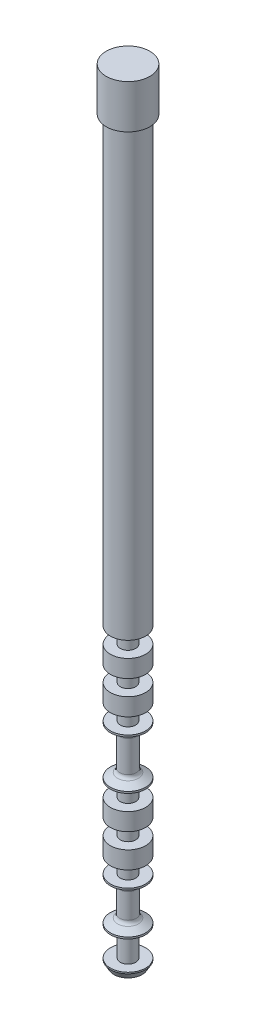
ISO-10303-21;
HEADER;
FILE_DESCRIPTION(('STEP AP214'),'2;1');
FILE_NAME('part.step','',(''),(''),'','','');
FILE_SCHEMA(('AUTOMOTIVE_DESIGN { 1 0 10303 214 1 1 1 1 }'));
ENDSEC;
DATA;
#1=APPLICATION_CONTEXT('core data for automotive mechanical design processes');
#2=APPLICATION_PROTOCOL_DEFINITION('international standard','automotive_design',2000,#1);
#3=PRODUCT_CONTEXT('',#1,'mechanical');
#4=PRODUCT('Part','Part','',(#3));
#5=PRODUCT_RELATED_PRODUCT_CATEGORY('part','',(#4));
#6=PRODUCT_DEFINITION_FORMATION('','',#4);
#7=PRODUCT_DEFINITION_CONTEXT('part definition',#1,'design');
#8=PRODUCT_DEFINITION('design','',#6,#7);
#9=PRODUCT_DEFINITION_SHAPE('','',#8);
#10=(LENGTH_UNIT() NAMED_UNIT(*) SI_UNIT(.MILLI.,.METRE.));
#11=(NAMED_UNIT(*) PLANE_ANGLE_UNIT() SI_UNIT($,.RADIAN.));
#12=(NAMED_UNIT(*) SI_UNIT($,.STERADIAN.) SOLID_ANGLE_UNIT());
#13=UNCERTAINTY_MEASURE_WITH_UNIT(LENGTH_MEASURE(1.E-05),#10,'distance_accuracy_value','');
#14=(GEOMETRIC_REPRESENTATION_CONTEXT(3) GLOBAL_UNCERTAINTY_ASSIGNED_CONTEXT((#13)) GLOBAL_UNIT_ASSIGNED_CONTEXT((#10,
#11,#12)) REPRESENTATION_CONTEXT('',''));
#15=CARTESIAN_POINT('',(0.,0.,0.));
#16=DIRECTION('',(0.,0.,1.));
#17=DIRECTION('',(1.,0.,0.));
#18=AXIS2_PLACEMENT_3D('',#15,#16,#17);
#19=CARTESIAN_POINT('',(58.02,-58.2,1.65));
#20=DIRECTION('',(0.,-1.,0.));
#21=DIRECTION('',(0.,0.,-1.));
#22=AXIS2_PLACEMENT_3D('',#19,#20,#21);
#23=PLANE('',#22);
#24=CARTESIAN_POINT('',(56.,-58.2,1.65));
#25=DIRECTION('',(0.,-1.,0.));
#26=DIRECTION('',(0.,0.,-1.));
#27=AXIS2_PLACEMENT_3D('',#24,#25,#26);
#28=CIRCLE('',#27,2.02000000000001);
#29=CARTESIAN_POINT('',(56.,-58.2,-0.370000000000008));
#30=VERTEX_POINT('',#29);
#31=EDGE_CURVE('E100',#30,#30,#28,.T.);
#32=ORIENTED_EDGE('',*,*,#31,.T.);
#33=EDGE_LOOP('',(#32));
#34=FACE_BOUND('',#33,.T.);
#35=CARTESIAN_POINT('',(56.,-58.2,1.65));
#36=DIRECTION('',(0.,-1.,0.));
#37=DIRECTION('',(0.,0.,-1.));
#38=AXIS2_PLACEMENT_3D('',#35,#36,#37);
#39=CIRCLE('',#38,0.880000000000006);
#40=CARTESIAN_POINT('',(56.,-58.2,0.769999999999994));
#41=VERTEX_POINT('',#40);
#42=EDGE_CURVE('E236',#41,#41,#39,.T.);
#43=ORIENTED_EDGE('',*,*,#42,.F.);
#44=EDGE_LOOP('',(#43));
#45=FACE_BOUND('',#44,.T.);
#46=ADVANCED_FACE('F50',(#34,#45),#23,.T.);
#47=CARTESIAN_POINT('',(56.,-1065.45754338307,1.65));
#48=DIRECTION('',(0.,-1.,0.));
#49=DIRECTION('',(0.,0.,-1.));
#50=AXIS2_PLACEMENT_3D('',#47,#48,#49);
#51=CYLINDRICAL_SURFACE('',#50,2.02);
#52=CARTESIAN_POINT('',(56.,-7.40000000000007,1.65));
#53=DIRECTION('',(0.,-1.,0.));
#54=DIRECTION('',(0.,0.,-1.));
#55=AXIS2_PLACEMENT_3D('',#52,#53,#54);
#56=CIRCLE('',#55,2.02);
#57=CARTESIAN_POINT('',(56.,-7.40000000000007,-0.370000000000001));
#58=VERTEX_POINT('',#57);
#59=EDGE_CURVE('E104',#58,#58,#56,.T.);
#60=ORIENTED_EDGE('',*,*,#59,.T.);
#61=EDGE_LOOP('',(#60));
#62=FACE_BOUND('',#61,.T.);
#63=ORIENTED_EDGE('',*,*,#31,.F.);
#64=EDGE_LOOP('',(#63));
#65=FACE_BOUND('',#64,.T.);
#66=ADVANCED_FACE('F246',(#62,#65),#51,.T.);
#67=CARTESIAN_POINT('',(58.02,-7.4,1.65));
#68=DIRECTION('',(0.,-1.,0.));
#69=DIRECTION('',(0.,0.,-1.));
#70=AXIS2_PLACEMENT_3D('',#67,#68,#69);
#71=PLANE('',#70);
#72=CARTESIAN_POINT('',(56.,-7.40000000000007,1.65));
#73=DIRECTION('',(0.,-1.,0.));
#74=DIRECTION('',(0.,0.,-1.));
#75=AXIS2_PLACEMENT_3D('',#72,#73,#74);
#76=CIRCLE('',#75,2.5);
#77=CARTESIAN_POINT('',(56.,-7.40000000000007,-0.850000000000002));
#78=VERTEX_POINT('',#77);
#79=EDGE_CURVE('E108',#78,#78,#76,.T.);
#80=ORIENTED_EDGE('',*,*,#79,.T.);
#81=EDGE_LOOP('',(#80));
#82=FACE_BOUND('',#81,.T.);
#83=ORIENTED_EDGE('',*,*,#59,.F.);
#84=EDGE_LOOP('',(#83));
#85=FACE_BOUND('',#84,.T.);
#86=ADVANCED_FACE('F252',(#82,#85),#71,.T.);
#87=CARTESIAN_POINT('',(56.,-1065.45754338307,1.65));
#88=DIRECTION('',(0.,-1.,0.));
#89=DIRECTION('',(0.,0.,-1.));
#90=AXIS2_PLACEMENT_3D('',#87,#88,#89);
#91=CYLINDRICAL_SURFACE('',#90,2.5);
#92=CARTESIAN_POINT('',(56.,-2.39999999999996,1.65));
#93=DIRECTION('',(0.,-1.,0.));
#94=DIRECTION('',(0.,0.,-1.));
#95=AXIS2_PLACEMENT_3D('',#92,#93,#94);
#96=CIRCLE('',#95,2.5);
#97=CARTESIAN_POINT('',(56.,-2.39999999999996,-0.850000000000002));
#98=VERTEX_POINT('',#97);
#99=EDGE_CURVE('E112',#98,#98,#96,.T.);
#100=ORIENTED_EDGE('',*,*,#99,.T.);
#101=EDGE_LOOP('',(#100));
#102=FACE_BOUND('',#101,.T.);
#103=ORIENTED_EDGE('',*,*,#79,.F.);
#104=EDGE_LOOP('',(#103));
#105=FACE_BOUND('',#104,.T.);
#106=ADVANCED_FACE('F385',(#102,#105),#91,.T.);
#107=CARTESIAN_POINT('',(58.5,-2.4,1.65));
#108=DIRECTION('',(0.,1.,0.));
#109=DIRECTION('',(0.,0.,1.));
#110=AXIS2_PLACEMENT_3D('',#107,#108,#109);
#111=PLANE('',#110);
#112=ORIENTED_EDGE('',*,*,#99,.F.);
#113=EDGE_LOOP('',(#112));
#114=FACE_BOUND('',#113,.T.);
#115=ADVANCED_FACE('F382',(#114),#111,.T.);
#116=CARTESIAN_POINT('',(58.02,-92.,1.65));
#117=DIRECTION('',(0.,-1.,0.));
#118=DIRECTION('',(0.,0.,-1.));
#119=AXIS2_PLACEMENT_3D('',#116,#117,#118);
#120=PLANE('',#119);
#121=CARTESIAN_POINT('',(56.,-92.,1.65));
#122=DIRECTION('',(0.,-1.,0.));
#123=DIRECTION('',(0.,0.,-1.));
#124=AXIS2_PLACEMENT_3D('',#121,#122,#123);
#125=CIRCLE('',#124,1.62);
#126=CARTESIAN_POINT('',(56.,-92.,0.0299999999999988));
#127=VERTEX_POINT('',#126);
#128=EDGE_CURVE('E58',#127,#127,#125,.T.);
#129=ORIENTED_EDGE('',*,*,#128,.T.);
#130=EDGE_LOOP('',(#129));
#131=FACE_BOUND('',#130,.T.);
#132=ADVANCED_FACE('F379',(#131),#120,.T.);
#133=CARTESIAN_POINT('',(56.,-1065.45754338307,1.65));
#134=DIRECTION('',(0.,-1.,0.));
#135=DIRECTION('',(0.,0.,-1.));
#136=AXIS2_PLACEMENT_3D('',#133,#134,#135);
#137=CYLINDRICAL_SURFACE('',#136,2.02000000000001);
#138=CARTESIAN_POINT('',(56.,-91.3071796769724,1.65));
#139=DIRECTION('',(0.,-1.,0.));
#140=DIRECTION('',(0.,0.,-1.));
#141=AXIS2_PLACEMENT_3D('',#138,#139,#140);
#142=CIRCLE('',#141,2.02000000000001);
#143=CARTESIAN_POINT('',(56.,-91.3071796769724,-0.370000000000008));
#144=VERTEX_POINT('',#143);
#145=EDGE_CURVE('E13',#144,#144,#142,.F.);
#146=ORIENTED_EDGE('',*,*,#145,.T.);
#147=EDGE_LOOP('',(#146));
#148=FACE_BOUND('',#147,.T.);
#149=CARTESIAN_POINT('',(56.,-91.1500000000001,1.65));
#150=DIRECTION('',(0.,-1.,0.));
#151=DIRECTION('',(0.,0.,-1.));
#152=AXIS2_PLACEMENT_3D('',#149,#150,#151);
#153=CIRCLE('',#152,2.02000000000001);
#154=CARTESIAN_POINT('',(56.,-91.1500000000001,-0.370000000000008));
#155=VERTEX_POINT('',#154);
#156=EDGE_CURVE('E116',#155,#155,#153,.T.);
#157=ORIENTED_EDGE('',*,*,#156,.T.);
#158=EDGE_LOOP('',(#157));
#159=FACE_BOUND('',#158,.T.);
#160=ADVANCED_FACE('F375',(#148,#159),#137,.T.);
#161=CARTESIAN_POINT('',(56.88,-91.15,1.65));
#162=DIRECTION('',(0.,1.,0.));
#163=DIRECTION('',(0.,0.,1.));
#164=AXIS2_PLACEMENT_3D('',#161,#162,#163);
#165=PLANE('',#164);
#166=CARTESIAN_POINT('',(56.,-91.1500000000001,1.65));
#167=DIRECTION('',(0.,-1.,0.));
#168=DIRECTION('',(0.,0.,-1.));
#169=AXIS2_PLACEMENT_3D('',#166,#167,#168);
#170=CIRCLE('',#169,0.879999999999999);
#171=CARTESIAN_POINT('',(56.,-91.1500000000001,0.770000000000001));
#172=VERTEX_POINT('',#171);
#173=EDGE_CURVE('E120',#172,#172,#170,.T.);
#174=ORIENTED_EDGE('',*,*,#173,.T.);
#175=EDGE_LOOP('',(#174));
#176=FACE_BOUND('',#175,.T.);
#177=ORIENTED_EDGE('',*,*,#156,.F.);
#178=EDGE_LOOP('',(#177));
#179=FACE_BOUND('',#178,.T.);
#180=ADVANCED_FACE('F371',(#176,#179),#165,.T.);
#181=CARTESIAN_POINT('',(56.,-1065.45754338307,1.65));
#182=DIRECTION('',(0.,-1.,0.));
#183=DIRECTION('',(0.,0.,-1.));
#184=AXIS2_PLACEMENT_3D('',#181,#182,#183);
#185=CYLINDRICAL_SURFACE('',#184,0.879999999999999);
#186=CARTESIAN_POINT('',(56.,-87.85,1.65));
#187=DIRECTION('',(0.,-1.,0.));
#188=DIRECTION('',(0.,0.,-1.));
#189=AXIS2_PLACEMENT_3D('',#186,#187,#188);
#190=CIRCLE('',#189,0.879999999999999);
#191=CARTESIAN_POINT('',(56.,-87.85,0.770000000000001));
#192=VERTEX_POINT('',#191);
#193=EDGE_CURVE('E124',#192,#192,#190,.T.);
#194=ORIENTED_EDGE('',*,*,#193,.T.);
#195=EDGE_LOOP('',(#194));
#196=FACE_BOUND('',#195,.T.);
#197=ORIENTED_EDGE('',*,*,#173,.F.);
#198=EDGE_LOOP('',(#197));
#199=FACE_BOUND('',#198,.T.);
#200=ADVANCED_FACE('F367',(#196,#199),#185,.T.);
#201=CARTESIAN_POINT('',(58.02,-87.85,1.65));
#202=DIRECTION('',(0.,-1.,0.));
#203=DIRECTION('',(0.,0.,-1.));
#204=AXIS2_PLACEMENT_3D('',#201,#202,#203);
#205=PLANE('',#204);
#206=CARTESIAN_POINT('',(56.,-87.85,1.65));
#207=DIRECTION('',(0.,-1.,0.));
#208=DIRECTION('',(0.,0.,-1.));
#209=AXIS2_PLACEMENT_3D('',#206,#207,#208);
#210=CIRCLE('',#209,2.02000000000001);
#211=CARTESIAN_POINT('',(56.,-87.85,-0.370000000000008));
#212=VERTEX_POINT('',#211);
#213=EDGE_CURVE('E128',#212,#212,#210,.T.);
#214=ORIENTED_EDGE('',*,*,#213,.T.);
#215=EDGE_LOOP('',(#214));
#216=FACE_BOUND('',#215,.T.);
#217=ORIENTED_EDGE('',*,*,#193,.F.);
#218=EDGE_LOOP('',(#217));
#219=FACE_BOUND('',#218,.T.);
#220=ADVANCED_FACE('F363',(#216,#219),#205,.T.);
#221=CARTESIAN_POINT('',(56.,-1065.45754338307,1.65));
#222=DIRECTION('',(0.,-1.,0.));
#223=DIRECTION('',(0.,0.,-1.));
#224=AXIS2_PLACEMENT_3D('',#221,#222,#223);
#225=CYLINDRICAL_SURFACE('',#224,2.02000000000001);
#226=CARTESIAN_POINT('',(56.,-87.65,1.65));
#227=DIRECTION('',(0.,-1.,0.));
#228=DIRECTION('',(0.,0.,-1.));
#229=AXIS2_PLACEMENT_3D('',#226,#227,#228);
#230=CIRCLE('',#229,2.02000000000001);
#231=CARTESIAN_POINT('',(56.,-87.65,-0.370000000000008));
#232=VERTEX_POINT('',#231);
#233=EDGE_CURVE('E132',#232,#232,#230,.T.);
#234=ORIENTED_EDGE('',*,*,#233,.T.);
#235=EDGE_LOOP('',(#234));
#236=FACE_BOUND('',#235,.T.);
#237=ORIENTED_EDGE('',*,*,#213,.F.);
#238=EDGE_LOOP('',(#237));
#239=FACE_BOUND('',#238,.T.);
#240=ADVANCED_FACE('F359',(#236,#239),#225,.T.);
#241=CARTESIAN_POINT('',(56.,-87.65,1.65));
#242=DIRECTION('',(0.,-1.,0.));
#243=DIRECTION('',(0.,0.,-1.));
#244=AXIS2_PLACEMENT_3D('',#241,#242,#243);
#245=CONICAL_SURFACE('',#244,2.02000000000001,1.04719755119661);
#246=CARTESIAN_POINT('',(56.,-87.1765727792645,1.65));
#247=DIRECTION('',(0.,-1.,0.));
#248=DIRECTION('',(0.,0.,-1.));
#249=AXIS2_PLACEMENT_3D('',#246,#247,#248);
#250=CIRCLE('',#249,1.19999999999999);
#251=CARTESIAN_POINT('',(56.,-87.1765727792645,0.450000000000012));
#252=VERTEX_POINT('',#251);
#253=EDGE_CURVE('E96',#252,#252,#250,.T.);
#254=ORIENTED_EDGE('',*,*,#253,.T.);
#255=EDGE_LOOP('',(#254));
#256=FACE_BOUND('',#255,.T.);
#257=ORIENTED_EDGE('',*,*,#233,.F.);
#258=EDGE_LOOP('',(#257));
#259=FACE_BOUND('',#258,.T.);
#260=ADVANCED_FACE('F355',(#256,#259),#245,.T.);
#261=CARTESIAN_POINT('',(56.,-1065.45754338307,1.65));
#262=DIRECTION('',(0.,-1.,0.));
#263=DIRECTION('',(0.,0.,-1.));
#264=AXIS2_PLACEMENT_3D('',#261,#262,#263);
#265=CYLINDRICAL_SURFACE('',#264,0.95);
#266=CARTESIAN_POINT('',(56.,-86.7435600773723,1.65));
#267=DIRECTION('',(0.,-1.,0.));
#268=DIRECTION('',(0.,0.,-1.));
#269=AXIS2_PLACEMENT_3D('',#266,#267,#268);
#270=CIRCLE('',#269,0.95);
#271=CARTESIAN_POINT('',(56.,-86.7435600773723,0.700000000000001));
#272=VERTEX_POINT('',#271);
#273=EDGE_CURVE('E88',#272,#272,#270,.F.);
#274=ORIENTED_EDGE('',*,*,#273,.T.);
#275=EDGE_LOOP('',(#274));
#276=FACE_BOUND('',#275,.T.);
#277=CARTESIAN_POINT('',(56.,-83.9064399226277,1.65));
#278=DIRECTION('',(0.,-1.,0.));
#279=DIRECTION('',(0.,0.,-1.));
#280=AXIS2_PLACEMENT_3D('',#277,#278,#279);
#281=CIRCLE('',#280,0.95);
#282=CARTESIAN_POINT('',(56.,-83.9064399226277,0.700000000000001));
#283=VERTEX_POINT('',#282);
#284=EDGE_CURVE('E92',#283,#283,#281,.T.);
#285=ORIENTED_EDGE('',*,*,#284,.T.);
#286=EDGE_LOOP('',(#285));
#287=FACE_BOUND('',#286,.T.);
#288=ADVANCED_FACE('F351',(#276,#287),#265,.T.);
#289=CARTESIAN_POINT('',(56.,-83.617764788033,1.65));
#290=DIRECTION('',(0.,1.,0.));
#291=DIRECTION('',(0.,0.,1.));
#292=AXIS2_PLACEMENT_3D('',#289,#290,#291);
#293=CONICAL_SURFACE('',#292,0.95,1.04719755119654);
#294=CARTESIAN_POINT('',(56.,-83.4734272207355,1.65));
#295=DIRECTION('',(0.,1.,0.));
#296=DIRECTION('',(0.,0.,1.));
#297=AXIS2_PLACEMENT_3D('',#294,#295,#296);
#298=CIRCLE('',#297,1.19999999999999);
#299=CARTESIAN_POINT('',(56.,-83.4734272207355,2.84999999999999));
#300=VERTEX_POINT('',#299);
#301=EDGE_CURVE('E84',#300,#300,#298,.T.);
#302=ORIENTED_EDGE('',*,*,#301,.T.);
#303=EDGE_LOOP('',(#302));
#304=FACE_BOUND('',#303,.T.);
#305=CARTESIAN_POINT('',(56.,-83.,1.65));
#306=DIRECTION('',(0.,-1.,0.));
#307=DIRECTION('',(0.,0.,-1.));
#308=AXIS2_PLACEMENT_3D('',#305,#306,#307);
#309=CIRCLE('',#308,2.02000000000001);
#310=CARTESIAN_POINT('',(56.,-83.,-0.370000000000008));
#311=VERTEX_POINT('',#310);
#312=EDGE_CURVE('E136',#311,#311,#309,.T.);
#313=ORIENTED_EDGE('',*,*,#312,.T.);
#314=EDGE_LOOP('',(#313));
#315=FACE_BOUND('',#314,.T.);
#316=ADVANCED_FACE('F347',(#304,#315),#293,.T.);
#317=CARTESIAN_POINT('',(56.,-1065.45754338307,1.65));
#318=DIRECTION('',(0.,-1.,0.));
#319=DIRECTION('',(0.,0.,-1.));
#320=AXIS2_PLACEMENT_3D('',#317,#318,#319);
#321=CYLINDRICAL_SURFACE('',#320,2.02000000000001);
#322=CARTESIAN_POINT('',(56.,-82.8,1.65));
#323=DIRECTION('',(0.,-1.,0.));
#324=DIRECTION('',(0.,0.,-1.));
#325=AXIS2_PLACEMENT_3D('',#322,#323,#324);
#326=CIRCLE('',#325,2.02000000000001);
#327=CARTESIAN_POINT('',(56.,-82.8,-0.370000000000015));
#328=VERTEX_POINT('',#327);
#329=EDGE_CURVE('E140',#328,#328,#326,.T.);
#330=ORIENTED_EDGE('',*,*,#329,.T.);
#331=EDGE_LOOP('',(#330));
#332=FACE_BOUND('',#331,.T.);
#333=ORIENTED_EDGE('',*,*,#312,.F.);
#334=EDGE_LOOP('',(#333));
#335=FACE_BOUND('',#334,.T.);
#336=ADVANCED_FACE('F343',(#332,#335),#321,.T.);
#337=CARTESIAN_POINT('',(56.88,-82.8,1.65));
#338=DIRECTION('',(0.,1.,0.));
#339=DIRECTION('',(0.,0.,1.));
#340=AXIS2_PLACEMENT_3D('',#337,#338,#339);
#341=PLANE('',#340);
#342=CARTESIAN_POINT('',(56.,-82.8,1.65));
#343=DIRECTION('',(0.,-1.,0.));
#344=DIRECTION('',(0.,0.,-1.));
#345=AXIS2_PLACEMENT_3D('',#342,#343,#344);
#346=CIRCLE('',#345,0.879999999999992);
#347=CARTESIAN_POINT('',(56.,-82.8,0.770000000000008));
#348=VERTEX_POINT('',#347);
#349=EDGE_CURVE('E144',#348,#348,#346,.T.);
#350=ORIENTED_EDGE('',*,*,#349,.T.);
#351=EDGE_LOOP('',(#350));
#352=FACE_BOUND('',#351,.T.);
#353=ORIENTED_EDGE('',*,*,#329,.F.);
#354=EDGE_LOOP('',(#353));
#355=FACE_BOUND('',#354,.T.);
#356=ADVANCED_FACE('F339',(#352,#355),#341,.T.);
#357=CARTESIAN_POINT('',(56.,-1065.45754338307,1.65));
#358=DIRECTION('',(0.,-1.,0.));
#359=DIRECTION('',(0.,0.,-1.));
#360=AXIS2_PLACEMENT_3D('',#357,#358,#359);
#361=CYLINDRICAL_SURFACE('',#360,0.879999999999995);
#362=CARTESIAN_POINT('',(56.,-81.,1.65));
#363=DIRECTION('',(0.,-1.,0.));
#364=DIRECTION('',(0.,0.,-1.));
#365=AXIS2_PLACEMENT_3D('',#362,#363,#364);
#366=CIRCLE('',#365,0.879999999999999);
#367=CARTESIAN_POINT('',(56.,-81.,0.770000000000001));
#368=VERTEX_POINT('',#367);
#369=EDGE_CURVE('E148',#368,#368,#366,.T.);
#370=ORIENTED_EDGE('',*,*,#369,.T.);
#371=EDGE_LOOP('',(#370));
#372=FACE_BOUND('',#371,.T.);
#373=ORIENTED_EDGE('',*,*,#349,.F.);
#374=EDGE_LOOP('',(#373));
#375=FACE_BOUND('',#374,.T.);
#376=ADVANCED_FACE('F335',(#372,#375),#361,.T.);
#377=CARTESIAN_POINT('',(58.02,-81.,1.65));
#378=DIRECTION('',(0.,-1.,0.));
#379=DIRECTION('',(0.,0.,-1.));
#380=AXIS2_PLACEMENT_3D('',#377,#378,#379);
#381=PLANE('',#380);
#382=CARTESIAN_POINT('',(56.,-81.,1.65));
#383=DIRECTION('',(0.,-1.,0.));
#384=DIRECTION('',(0.,0.,-1.));
#385=AXIS2_PLACEMENT_3D('',#382,#383,#384);
#386=CIRCLE('',#385,2.02);
#387=CARTESIAN_POINT('',(56.,-81.,-0.370000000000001));
#388=VERTEX_POINT('',#387);
#389=EDGE_CURVE('E152',#388,#388,#386,.T.);
#390=ORIENTED_EDGE('',*,*,#389,.T.);
#391=EDGE_LOOP('',(#390));
#392=FACE_BOUND('',#391,.T.);
#393=ORIENTED_EDGE('',*,*,#369,.F.);
#394=EDGE_LOOP('',(#393));
#395=FACE_BOUND('',#394,.T.);
#396=ADVANCED_FACE('F331',(#392,#395),#381,.T.);
#397=CARTESIAN_POINT('',(56.,-1065.45754338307,1.65));
#398=DIRECTION('',(0.,-1.,0.));
#399=DIRECTION('',(0.,0.,-1.));
#400=AXIS2_PLACEMENT_3D('',#397,#398,#399);
#401=CYLINDRICAL_SURFACE('',#400,2.02);
#402=CARTESIAN_POINT('',(56.,-79.,1.65));
#403=DIRECTION('',(0.,-1.,0.));
#404=DIRECTION('',(0.,0.,-1.));
#405=AXIS2_PLACEMENT_3D('',#402,#403,#404);
#406=CIRCLE('',#405,2.02);
#407=CARTESIAN_POINT('',(56.,-79.,-0.370000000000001));
#408=VERTEX_POINT('',#407);
#409=EDGE_CURVE('E156',#408,#408,#406,.T.);
#410=ORIENTED_EDGE('',*,*,#409,.T.);
#411=EDGE_LOOP('',(#410));
#412=FACE_BOUND('',#411,.T.);
#413=ORIENTED_EDGE('',*,*,#389,.F.);
#414=EDGE_LOOP('',(#413));
#415=FACE_BOUND('',#414,.T.);
#416=ADVANCED_FACE('F327',(#412,#415),#401,.T.);
#417=CARTESIAN_POINT('',(56.88,-79.,1.65));
#418=DIRECTION('',(0.,1.,0.));
#419=DIRECTION('',(0.,0.,1.));
#420=AXIS2_PLACEMENT_3D('',#417,#418,#419);
#421=PLANE('',#420);
#422=CARTESIAN_POINT('',(56.,-79.,1.65));
#423=DIRECTION('',(0.,-1.,0.));
#424=DIRECTION('',(0.,0.,-1.));
#425=AXIS2_PLACEMENT_3D('',#422,#423,#424);
#426=CIRCLE('',#425,0.879999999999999);
#427=CARTESIAN_POINT('',(56.,-79.,0.770000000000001));
#428=VERTEX_POINT('',#427);
#429=EDGE_CURVE('E160',#428,#428,#426,.T.);
#430=ORIENTED_EDGE('',*,*,#429,.T.);
#431=EDGE_LOOP('',(#430));
#432=FACE_BOUND('',#431,.T.);
#433=ORIENTED_EDGE('',*,*,#409,.F.);
#434=EDGE_LOOP('',(#433));
#435=FACE_BOUND('',#434,.T.);
#436=ADVANCED_FACE('F323',(#432,#435),#421,.T.);
#437=CARTESIAN_POINT('',(56.,-1065.45754338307,1.65));
#438=DIRECTION('',(0.,-1.,0.));
#439=DIRECTION('',(0.,0.,-1.));
#440=AXIS2_PLACEMENT_3D('',#437,#438,#439);
#441=CYLINDRICAL_SURFACE('',#440,0.879999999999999);
#442=CARTESIAN_POINT('',(56.,-77.2,1.65));
#443=DIRECTION('',(0.,-1.,0.));
#444=DIRECTION('',(0.,0.,-1.));
#445=AXIS2_PLACEMENT_3D('',#442,#443,#444);
#446=CIRCLE('',#445,0.879999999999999);
#447=CARTESIAN_POINT('',(56.,-77.2,0.770000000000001));
#448=VERTEX_POINT('',#447);
#449=EDGE_CURVE('E164',#448,#448,#446,.T.);
#450=ORIENTED_EDGE('',*,*,#449,.T.);
#451=EDGE_LOOP('',(#450));
#452=FACE_BOUND('',#451,.T.);
#453=ORIENTED_EDGE('',*,*,#429,.F.);
#454=EDGE_LOOP('',(#453));
#455=FACE_BOUND('',#454,.T.);
#456=ADVANCED_FACE('F319',(#452,#455),#441,.T.);
#457=CARTESIAN_POINT('',(58.02,-77.2,1.65));
#458=DIRECTION('',(0.,-1.,0.));
#459=DIRECTION('',(0.,0.,-1.));
#460=AXIS2_PLACEMENT_3D('',#457,#458,#459);
#461=PLANE('',#460);
#462=CARTESIAN_POINT('',(56.,-77.2,1.65));
#463=DIRECTION('',(0.,-1.,0.));
#464=DIRECTION('',(0.,0.,-1.));
#465=AXIS2_PLACEMENT_3D('',#462,#463,#464);
#466=CIRCLE('',#465,2.02);
#467=CARTESIAN_POINT('',(56.,-77.2,-0.370000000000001));
#468=VERTEX_POINT('',#467);
#469=EDGE_CURVE('E168',#468,#468,#466,.T.);
#470=ORIENTED_EDGE('',*,*,#469,.T.);
#471=EDGE_LOOP('',(#470));
#472=FACE_BOUND('',#471,.T.);
#473=ORIENTED_EDGE('',*,*,#449,.F.);
#474=EDGE_LOOP('',(#473));
#475=FACE_BOUND('',#474,.T.);
#476=ADVANCED_FACE('F315',(#472,#475),#461,.T.);
#477=CARTESIAN_POINT('',(56.,-1065.45754338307,1.65));
#478=DIRECTION('',(0.,-1.,0.));
#479=DIRECTION('',(0.,0.,-1.));
#480=AXIS2_PLACEMENT_3D('',#477,#478,#479);
#481=CYLINDRICAL_SURFACE('',#480,2.02);
#482=CARTESIAN_POINT('',(56.,-75.2,1.65));
#483=DIRECTION('',(0.,-1.,0.));
#484=DIRECTION('',(0.,0.,-1.));
#485=AXIS2_PLACEMENT_3D('',#482,#483,#484);
#486=CIRCLE('',#485,2.02);
#487=CARTESIAN_POINT('',(56.,-75.2,-0.370000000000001));
#488=VERTEX_POINT('',#487);
#489=EDGE_CURVE('E172',#488,#488,#486,.T.);
#490=ORIENTED_EDGE('',*,*,#489,.T.);
#491=EDGE_LOOP('',(#490));
#492=FACE_BOUND('',#491,.T.);
#493=ORIENTED_EDGE('',*,*,#469,.F.);
#494=EDGE_LOOP('',(#493));
#495=FACE_BOUND('',#494,.T.);
#496=ADVANCED_FACE('F311',(#492,#495),#481,.T.);
#497=CARTESIAN_POINT('',(56.88,-75.2,1.65));
#498=DIRECTION('',(0.,1.,0.));
#499=DIRECTION('',(0.,0.,1.));
#500=AXIS2_PLACEMENT_3D('',#497,#498,#499);
#501=PLANE('',#500);
#502=CARTESIAN_POINT('',(56.,-75.2,1.65));
#503=DIRECTION('',(0.,-1.,0.));
#504=DIRECTION('',(0.,0.,-1.));
#505=AXIS2_PLACEMENT_3D('',#502,#503,#504);
#506=CIRCLE('',#505,0.879999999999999);
#507=CARTESIAN_POINT('',(56.,-75.2,0.770000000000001));
#508=VERTEX_POINT('',#507);
#509=EDGE_CURVE('E176',#508,#508,#506,.T.);
#510=ORIENTED_EDGE('',*,*,#509,.T.);
#511=EDGE_LOOP('',(#510));
#512=FACE_BOUND('',#511,.T.);
#513=ORIENTED_EDGE('',*,*,#489,.F.);
#514=EDGE_LOOP('',(#513));
#515=FACE_BOUND('',#514,.T.);
#516=ADVANCED_FACE('F307',(#512,#515),#501,.T.);
#517=CARTESIAN_POINT('',(56.,-1065.45754338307,1.65));
#518=DIRECTION('',(0.,-1.,0.));
#519=DIRECTION('',(0.,0.,-1.));
#520=AXIS2_PLACEMENT_3D('',#517,#518,#519);
#521=CYLINDRICAL_SURFACE('',#520,0.879999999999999);
#522=CARTESIAN_POINT('',(56.,-73.4,1.65));
#523=DIRECTION('',(0.,-1.,0.));
#524=DIRECTION('',(0.,0.,-1.));
#525=AXIS2_PLACEMENT_3D('',#522,#523,#524);
#526=CIRCLE('',#525,0.879999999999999);
#527=CARTESIAN_POINT('',(56.,-73.4,0.770000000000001));
#528=VERTEX_POINT('',#527);
#529=EDGE_CURVE('E180',#528,#528,#526,.T.);
#530=ORIENTED_EDGE('',*,*,#529,.T.);
#531=EDGE_LOOP('',(#530));
#532=FACE_BOUND('',#531,.T.);
#533=ORIENTED_EDGE('',*,*,#509,.F.);
#534=EDGE_LOOP('',(#533));
#535=FACE_BOUND('',#534,.T.);
#536=ADVANCED_FACE('F303',(#532,#535),#521,.T.);
#537=CARTESIAN_POINT('',(58.02,-73.4,1.65));
#538=DIRECTION('',(0.,-1.,0.));
#539=DIRECTION('',(0.,0.,-1.));
#540=AXIS2_PLACEMENT_3D('',#537,#538,#539);
#541=PLANE('',#540);
#542=CARTESIAN_POINT('',(56.,-73.4,1.65));
#543=DIRECTION('',(0.,-1.,0.));
#544=DIRECTION('',(0.,0.,-1.));
#545=AXIS2_PLACEMENT_3D('',#542,#543,#544);
#546=CIRCLE('',#545,2.02);
#547=CARTESIAN_POINT('',(56.,-73.4,-0.370000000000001));
#548=VERTEX_POINT('',#547);
#549=EDGE_CURVE('E184',#548,#548,#546,.T.);
#550=ORIENTED_EDGE('',*,*,#549,.T.);
#551=EDGE_LOOP('',(#550));
#552=FACE_BOUND('',#551,.T.);
#553=ORIENTED_EDGE('',*,*,#529,.F.);
#554=EDGE_LOOP('',(#553));
#555=FACE_BOUND('',#554,.T.);
#556=ADVANCED_FACE('F299',(#552,#555),#541,.T.);
#557=CARTESIAN_POINT('',(56.,-1065.45754338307,1.65));
#558=DIRECTION('',(0.,-1.,0.));
#559=DIRECTION('',(0.,0.,-1.));
#560=AXIS2_PLACEMENT_3D('',#557,#558,#559);
#561=CYLINDRICAL_SURFACE('',#560,2.02);
#562=CARTESIAN_POINT('',(56.,-73.2,1.65));
#563=DIRECTION('',(0.,-1.,0.));
#564=DIRECTION('',(0.,0.,-1.));
#565=AXIS2_PLACEMENT_3D('',#562,#563,#564);
#566=CIRCLE('',#565,2.02);
#567=CARTESIAN_POINT('',(56.,-73.2,-0.370000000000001));
#568=VERTEX_POINT('',#567);
#569=EDGE_CURVE('E188',#568,#568,#566,.T.);
#570=ORIENTED_EDGE('',*,*,#569,.T.);
#571=EDGE_LOOP('',(#570));
#572=FACE_BOUND('',#571,.T.);
#573=ORIENTED_EDGE('',*,*,#549,.F.);
#574=EDGE_LOOP('',(#573));
#575=FACE_BOUND('',#574,.T.);
#576=ADVANCED_FACE('F292',(#572,#575),#561,.T.);
#577=CARTESIAN_POINT('',(56.,-73.2,1.65));
#578=DIRECTION('',(0.,-1.,0.));
#579=DIRECTION('',(0.,0.,-1.));
#580=AXIS2_PLACEMENT_3D('',#577,#578,#579);
#581=CONICAL_SURFACE('',#580,2.02,1.04719755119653);
#582=CARTESIAN_POINT('',(56.,-72.7265727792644,1.65));
#583=DIRECTION('',(0.,-1.,0.));
#584=DIRECTION('',(0.,0.,-1.));
#585=AXIS2_PLACEMENT_3D('',#582,#583,#584);
#586=CIRCLE('',#585,1.19999999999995);
#587=CARTESIAN_POINT('',(56.,-72.7265727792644,0.450000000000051));
#588=VERTEX_POINT('',#587);
#589=EDGE_CURVE('E80',#588,#588,#586,.T.);
#590=ORIENTED_EDGE('',*,*,#589,.T.);
#591=EDGE_LOOP('',(#590));
#592=FACE_BOUND('',#591,.T.);
#593=ORIENTED_EDGE('',*,*,#569,.F.);
#594=EDGE_LOOP('',(#593));
#595=FACE_BOUND('',#594,.T.);
#596=ADVANCED_FACE('F282',(#592,#595),#581,.T.);
#597=CARTESIAN_POINT('',(56.,-1065.45754338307,1.65));
#598=DIRECTION('',(0.,-1.,0.));
#599=DIRECTION('',(0.,0.,-1.));
#600=AXIS2_PLACEMENT_3D('',#597,#598,#599);
#601=CYLINDRICAL_SURFACE('',#600,0.95);
#602=CARTESIAN_POINT('',(56.,-72.2935600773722,1.65));
#603=DIRECTION('',(0.,-1.,0.));
#604=DIRECTION('',(0.,0.,-1.));
#605=AXIS2_PLACEMENT_3D('',#602,#603,#604);
#606=CIRCLE('',#605,0.95);
#607=CARTESIAN_POINT('',(56.,-72.2935600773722,0.700000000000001));
#608=VERTEX_POINT('',#607);
#609=EDGE_CURVE('E70',#608,#608,#606,.F.);
#610=ORIENTED_EDGE('',*,*,#609,.T.);
#611=EDGE_LOOP('',(#610));
#612=FACE_BOUND('',#611,.T.);
#613=CARTESIAN_POINT('',(56.,-68.7064399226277,1.65));
#614=DIRECTION('',(0.,-1.,0.));
#615=DIRECTION('',(0.,0.,-1.));
#616=AXIS2_PLACEMENT_3D('',#613,#614,#615);
#617=CIRCLE('',#616,0.95);
#618=CARTESIAN_POINT('',(56.,-68.7064399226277,0.700000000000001));
#619=VERTEX_POINT('',#618);
#620=EDGE_CURVE('E76',#619,#619,#617,.T.);
#621=ORIENTED_EDGE('',*,*,#620,.T.);
#622=EDGE_LOOP('',(#621));
#623=FACE_BOUND('',#622,.T.);
#624=ADVANCED_FACE('F279',(#612,#623),#601,.T.);
#625=CARTESIAN_POINT('',(56.,-68.4177647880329,1.65));
#626=DIRECTION('',(0.,1.,0.));
#627=DIRECTION('',(0.,0.,1.));
#628=AXIS2_PLACEMENT_3D('',#625,#626,#627);
#629=CONICAL_SURFACE('',#628,0.95,1.04719755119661);
#630=CARTESIAN_POINT('',(56.,-68.2734272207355,1.65));
#631=DIRECTION('',(0.,1.,0.));
#632=DIRECTION('',(0.,0.,1.));
#633=AXIS2_PLACEMENT_3D('',#630,#631,#632);
#634=CIRCLE('',#633,1.19999999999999);
#635=CARTESIAN_POINT('',(56.,-68.2734272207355,2.84999999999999));
#636=VERTEX_POINT('',#635);
#637=EDGE_CURVE('E64',#636,#636,#634,.T.);
#638=ORIENTED_EDGE('',*,*,#637,.T.);
#639=EDGE_LOOP('',(#638));
#640=FACE_BOUND('',#639,.T.);
#641=CARTESIAN_POINT('',(56.,-67.8,1.65));
#642=DIRECTION('',(0.,-1.,0.));
#643=DIRECTION('',(0.,0.,-1.));
#644=AXIS2_PLACEMENT_3D('',#641,#642,#643);
#645=CIRCLE('',#644,2.02);
#646=CARTESIAN_POINT('',(56.,-67.8,-0.370000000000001));
#647=VERTEX_POINT('',#646);
#648=EDGE_CURVE('E192',#647,#647,#645,.T.);
#649=ORIENTED_EDGE('',*,*,#648,.T.);
#650=EDGE_LOOP('',(#649));
#651=FACE_BOUND('',#650,.T.);
#652=ADVANCED_FACE('F281',(#640,#651),#629,.T.);
#653=CARTESIAN_POINT('',(56.,-1065.45754338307,1.65));
#654=DIRECTION('',(0.,-1.,0.));
#655=DIRECTION('',(0.,0.,-1.));
#656=AXIS2_PLACEMENT_3D('',#653,#654,#655);
#657=CYLINDRICAL_SURFACE('',#656,2.02);
#658=CARTESIAN_POINT('',(56.,-67.6,1.65));
#659=DIRECTION('',(0.,-1.,0.));
#660=DIRECTION('',(0.,0.,-1.));
#661=AXIS2_PLACEMENT_3D('',#658,#659,#660);
#662=CIRCLE('',#661,2.02);
#663=CARTESIAN_POINT('',(56.,-67.6,-0.370000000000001));
#664=VERTEX_POINT('',#663);
#665=EDGE_CURVE('E196',#664,#664,#662,.T.);
#666=ORIENTED_EDGE('',*,*,#665,.T.);
#667=EDGE_LOOP('',(#666));
#668=FACE_BOUND('',#667,.T.);
#669=ORIENTED_EDGE('',*,*,#648,.F.);
#670=EDGE_LOOP('',(#669));
#671=FACE_BOUND('',#670,.T.);
#672=ADVANCED_FACE('F289',(#668,#671),#657,.T.);
#673=CARTESIAN_POINT('',(56.88,-67.6,1.65));
#674=DIRECTION('',(0.,1.,0.));
#675=DIRECTION('',(0.,0.,1.));
#676=AXIS2_PLACEMENT_3D('',#673,#674,#675);
#677=PLANE('',#676);
#678=CARTESIAN_POINT('',(56.,-67.6,1.65));
#679=DIRECTION('',(0.,-1.,0.));
#680=DIRECTION('',(0.,0.,-1.));
#681=AXIS2_PLACEMENT_3D('',#678,#679,#680);
#682=CIRCLE('',#681,0.879999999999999);
#683=CARTESIAN_POINT('',(56.,-67.6,0.770000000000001));
#684=VERTEX_POINT('',#683);
#685=EDGE_CURVE('E200',#684,#684,#682,.T.);
#686=ORIENTED_EDGE('',*,*,#685,.T.);
#687=EDGE_LOOP('',(#686));
#688=FACE_BOUND('',#687,.T.);
#689=ORIENTED_EDGE('',*,*,#665,.F.);
#690=EDGE_LOOP('',(#689));
#691=FACE_BOUND('',#690,.T.);
#692=ADVANCED_FACE('F521',(#688,#691),#677,.T.);
#693=CARTESIAN_POINT('',(56.,-1065.45754338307,1.65));
#694=DIRECTION('',(0.,-1.,0.));
#695=DIRECTION('',(0.,0.,-1.));
#696=AXIS2_PLACEMENT_3D('',#693,#694,#695);
#697=CYLINDRICAL_SURFACE('',#696,0.879999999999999);
#698=CARTESIAN_POINT('',(56.,-65.8,1.65));
#699=DIRECTION('',(0.,-1.,0.));
#700=DIRECTION('',(0.,0.,-1.));
#701=AXIS2_PLACEMENT_3D('',#698,#699,#700);
#702=CIRCLE('',#701,0.879999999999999);
#703=CARTESIAN_POINT('',(56.,-65.8,0.770000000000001));
#704=VERTEX_POINT('',#703);
#705=EDGE_CURVE('E204',#704,#704,#702,.T.);
#706=ORIENTED_EDGE('',*,*,#705,.T.);
#707=EDGE_LOOP('',(#706));
#708=FACE_BOUND('',#707,.T.);
#709=ORIENTED_EDGE('',*,*,#685,.F.);
#710=EDGE_LOOP('',(#709));
#711=FACE_BOUND('',#710,.T.);
#712=ADVANCED_FACE('F530',(#708,#711),#697,.T.);
#713=CARTESIAN_POINT('',(58.02,-65.8,1.65));
#714=DIRECTION('',(0.,-1.,0.));
#715=DIRECTION('',(0.,0.,-1.));
#716=AXIS2_PLACEMENT_3D('',#713,#714,#715);
#717=PLANE('',#716);
#718=CARTESIAN_POINT('',(56.,-65.8,1.65));
#719=DIRECTION('',(0.,-1.,0.));
#720=DIRECTION('',(0.,0.,-1.));
#721=AXIS2_PLACEMENT_3D('',#718,#719,#720);
#722=CIRCLE('',#721,2.02);
#723=CARTESIAN_POINT('',(56.,-65.8,-0.370000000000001));
#724=VERTEX_POINT('',#723);
#725=EDGE_CURVE('E208',#724,#724,#722,.T.);
#726=ORIENTED_EDGE('',*,*,#725,.T.);
#727=EDGE_LOOP('',(#726));
#728=FACE_BOUND('',#727,.T.);
#729=ORIENTED_EDGE('',*,*,#705,.F.);
#730=EDGE_LOOP('',(#729));
#731=FACE_BOUND('',#730,.T.);
#732=ADVANCED_FACE('F540',(#728,#731),#717,.T.);
#733=CARTESIAN_POINT('',(56.,-1065.45754338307,1.65));
#734=DIRECTION('',(0.,-1.,0.));
#735=DIRECTION('',(0.,0.,-1.));
#736=AXIS2_PLACEMENT_3D('',#733,#734,#735);
#737=CYLINDRICAL_SURFACE('',#736,2.02);
#738=CARTESIAN_POINT('',(56.,-63.8000000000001,1.65));
#739=DIRECTION('',(0.,-1.,0.));
#740=DIRECTION('',(0.,0.,-1.));
#741=AXIS2_PLACEMENT_3D('',#738,#739,#740);
#742=CIRCLE('',#741,2.02);
#743=CARTESIAN_POINT('',(56.,-63.8000000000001,-0.370000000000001));
#744=VERTEX_POINT('',#743);
#745=EDGE_CURVE('E212',#744,#744,#742,.T.);
#746=ORIENTED_EDGE('',*,*,#745,.T.);
#747=EDGE_LOOP('',(#746));
#748=FACE_BOUND('',#747,.T.);
#749=ORIENTED_EDGE('',*,*,#725,.F.);
#750=EDGE_LOOP('',(#749));
#751=FACE_BOUND('',#750,.T.);
#752=ADVANCED_FACE('F550',(#748,#751),#737,.T.);
#753=CARTESIAN_POINT('',(58.02,-63.8,1.65));
#754=DIRECTION('',(0.,1.,0.));
#755=DIRECTION('',(0.,0.,1.));
#756=AXIS2_PLACEMENT_3D('',#753,#754,#755);
#757=PLANE('',#756);
#758=CARTESIAN_POINT('',(56.,-63.8000000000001,1.65));
#759=DIRECTION('',(0.,-1.,0.));
#760=DIRECTION('',(0.,0.,-1.));
#761=AXIS2_PLACEMENT_3D('',#758,#759,#760);
#762=CIRCLE('',#761,0.879999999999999);
#763=CARTESIAN_POINT('',(56.,-63.8000000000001,0.770000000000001));
#764=VERTEX_POINT('',#763);
#765=EDGE_CURVE('E216',#764,#764,#762,.T.);
#766=ORIENTED_EDGE('',*,*,#765,.T.);
#767=EDGE_LOOP('',(#766));
#768=FACE_BOUND('',#767,.T.);
#769=ORIENTED_EDGE('',*,*,#745,.F.);
#770=EDGE_LOOP('',(#769));
#771=FACE_BOUND('',#770,.T.);
#772=ADVANCED_FACE('F560',(#768,#771),#757,.T.);
#773=CARTESIAN_POINT('',(56.,-1065.45754338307,1.65));
#774=DIRECTION('',(0.,-1.,0.));
#775=DIRECTION('',(0.,0.,-1.));
#776=AXIS2_PLACEMENT_3D('',#773,#774,#775);
#777=CYLINDRICAL_SURFACE('',#776,0.879999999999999);
#778=CARTESIAN_POINT('',(56.,-62.0000000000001,1.65));
#779=DIRECTION('',(0.,-1.,0.));
#780=DIRECTION('',(0.,0.,-1.));
#781=AXIS2_PLACEMENT_3D('',#778,#779,#780);
#782=CIRCLE('',#781,0.879999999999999);
#783=CARTESIAN_POINT('',(56.,-62.0000000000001,0.770000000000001));
#784=VERTEX_POINT('',#783);
#785=EDGE_CURVE('E220',#784,#784,#782,.T.);
#786=ORIENTED_EDGE('',*,*,#785,.T.);
#787=EDGE_LOOP('',(#786));
#788=FACE_BOUND('',#787,.T.);
#789=ORIENTED_EDGE('',*,*,#765,.F.);
#790=EDGE_LOOP('',(#789));
#791=FACE_BOUND('',#790,.T.);
#792=ADVANCED_FACE('F570',(#788,#791),#777,.T.);
#793=CARTESIAN_POINT('',(56.88,-62.,1.65));
#794=DIRECTION('',(0.,-1.,0.));
#795=DIRECTION('',(0.,0.,-1.));
#796=AXIS2_PLACEMENT_3D('',#793,#794,#795);
#797=PLANE('',#796);
#798=CARTESIAN_POINT('',(56.,-62.0000000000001,1.65));
#799=DIRECTION('',(0.,-1.,0.));
#800=DIRECTION('',(0.,0.,-1.));
#801=AXIS2_PLACEMENT_3D('',#798,#799,#800);
#802=CIRCLE('',#801,2.02000000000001);
#803=CARTESIAN_POINT('',(56.,-62.0000000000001,-0.370000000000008));
#804=VERTEX_POINT('',#803);
#805=EDGE_CURVE('E224',#804,#804,#802,.T.);
#806=ORIENTED_EDGE('',*,*,#805,.T.);
#807=EDGE_LOOP('',(#806));
#808=FACE_BOUND('',#807,.T.);
#809=ORIENTED_EDGE('',*,*,#785,.F.);
#810=EDGE_LOOP('',(#809));
#811=FACE_BOUND('',#810,.T.);
#812=ADVANCED_FACE('F580',(#808,#811),#797,.T.);
#813=CARTESIAN_POINT('',(56.,-1065.45754338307,1.65));
#814=DIRECTION('',(0.,-1.,0.));
#815=DIRECTION('',(0.,0.,-1.));
#816=AXIS2_PLACEMENT_3D('',#813,#814,#815);
#817=CYLINDRICAL_SURFACE('',#816,2.02);
#818=CARTESIAN_POINT('',(56.,-60.0000000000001,1.65));
#819=DIRECTION('',(0.,-1.,0.));
#820=DIRECTION('',(0.,0.,-1.));
#821=AXIS2_PLACEMENT_3D('',#818,#819,#820);
#822=CIRCLE('',#821,2.02);
#823=CARTESIAN_POINT('',(56.,-60.0000000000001,-0.370000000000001));
#824=VERTEX_POINT('',#823);
#825=EDGE_CURVE('E228',#824,#824,#822,.T.);
#826=ORIENTED_EDGE('',*,*,#825,.T.);
#827=EDGE_LOOP('',(#826));
#828=FACE_BOUND('',#827,.T.);
#829=ORIENTED_EDGE('',*,*,#805,.F.);
#830=EDGE_LOOP('',(#829));
#831=FACE_BOUND('',#830,.T.);
#832=ADVANCED_FACE('F589',(#828,#831),#817,.T.);
#833=CARTESIAN_POINT('',(56.88,-60.,1.65));
#834=DIRECTION('',(0.,1.,0.));
#835=DIRECTION('',(0.,0.,1.));
#836=AXIS2_PLACEMENT_3D('',#833,#834,#835);
#837=PLANE('',#836);
#838=CARTESIAN_POINT('',(56.,-60.0000000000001,1.65));
#839=DIRECTION('',(0.,-1.,0.));
#840=DIRECTION('',(0.,0.,-1.));
#841=AXIS2_PLACEMENT_3D('',#838,#839,#840);
#842=CIRCLE('',#841,0.879999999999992);
#843=CARTESIAN_POINT('',(56.,-60.0000000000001,0.770000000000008));
#844=VERTEX_POINT('',#843);
#845=EDGE_CURVE('E232',#844,#844,#842,.T.);
#846=ORIENTED_EDGE('',*,*,#845,.T.);
#847=EDGE_LOOP('',(#846));
#848=FACE_BOUND('',#847,.T.);
#849=ORIENTED_EDGE('',*,*,#825,.F.);
#850=EDGE_LOOP('',(#849));
#851=FACE_BOUND('',#850,.T.);
#852=ADVANCED_FACE('F600',(#848,#851),#837,.T.);
#853=CARTESIAN_POINT('',(56.,-1065.45754338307,1.65));
#854=DIRECTION('',(0.,-1.,0.));
#855=DIRECTION('',(0.,0.,-1.));
#856=AXIS2_PLACEMENT_3D('',#853,#854,#855);
#857=CYLINDRICAL_SURFACE('',#856,0.879999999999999);
#858=ORIENTED_EDGE('',*,*,#42,.T.);
#859=EDGE_LOOP('',(#858));
#860=FACE_BOUND('',#859,.T.);
#861=ORIENTED_EDGE('',*,*,#845,.F.);
#862=EDGE_LOOP('',(#861));
#863=FACE_BOUND('',#862,.T.);
#864=ADVANCED_FACE('F242',(#860,#863),#857,.T.);
#865=CARTESIAN_POINT('',(56.,-86.7435600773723,1.65));
#866=DIRECTION('',(0.,-1.,0.));
#867=DIRECTION('',(0.,0.,-1.));
#868=AXIS2_PLACEMENT_3D('',#865,#866,#867);
#869=TOROIDAL_SURFACE('',#868,1.45,0.5);
#870=ORIENTED_EDGE('',*,*,#273,.F.);
#871=EDGE_LOOP('',(#870));
#872=FACE_BOUND('',#871,.T.);
#873=ORIENTED_EDGE('',*,*,#253,.F.);
#874=EDGE_LOOP('',(#873));
#875=FACE_BOUND('',#874,.T.);
#876=ADVANCED_FACE('F257',(#872,#875),#869,.F.);
#877=CARTESIAN_POINT('',(56.,-83.9064399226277,1.65));
#878=DIRECTION('',(0.,-1.,0.));
#879=DIRECTION('',(0.,0.,-1.));
#880=AXIS2_PLACEMENT_3D('',#877,#878,#879);
#881=TOROIDAL_SURFACE('',#880,1.45,0.5);
#882=ORIENTED_EDGE('',*,*,#301,.F.);
#883=EDGE_LOOP('',(#882));
#884=FACE_BOUND('',#883,.T.);
#885=ORIENTED_EDGE('',*,*,#284,.F.);
#886=EDGE_LOOP('',(#885));
#887=FACE_BOUND('',#886,.T.);
#888=ADVANCED_FACE('F260',(#884,#887),#881,.F.);
#889=CARTESIAN_POINT('',(56.,-72.2935600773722,1.65));
#890=DIRECTION('',(0.,-1.,0.));
#891=DIRECTION('',(0.,0.,-1.));
#892=AXIS2_PLACEMENT_3D('',#889,#890,#891);
#893=TOROIDAL_SURFACE('',#892,1.45,0.5);
#894=ORIENTED_EDGE('',*,*,#609,.F.);
#895=EDGE_LOOP('',(#894));
#896=FACE_BOUND('',#895,.T.);
#897=ORIENTED_EDGE('',*,*,#589,.F.);
#898=EDGE_LOOP('',(#897));
#899=FACE_BOUND('',#898,.T.);
#900=ADVANCED_FACE('F264',(#896,#899),#893,.F.);
#901=CARTESIAN_POINT('',(56.,-68.7064399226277,1.65));
#902=DIRECTION('',(0.,-1.,0.));
#903=DIRECTION('',(0.,0.,-1.));
#904=AXIS2_PLACEMENT_3D('',#901,#902,#903);
#905=TOROIDAL_SURFACE('',#904,1.45,0.5);
#906=ORIENTED_EDGE('',*,*,#637,.F.);
#907=EDGE_LOOP('',(#906));
#908=FACE_BOUND('',#907,.T.);
#909=ORIENTED_EDGE('',*,*,#620,.F.);
#910=EDGE_LOOP('',(#909));
#911=FACE_BOUND('',#910,.T.);
#912=ADVANCED_FACE('F267',(#908,#911),#905,.F.);
#913=CARTESIAN_POINT('',(56.,-92.,1.65));
#914=DIRECTION('',(0.,1.,0.));
#915=DIRECTION('',(0.,0.,1.));
#916=AXIS2_PLACEMENT_3D('',#913,#914,#915);
#917=CONICAL_SURFACE('',#916,1.62000000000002,0.523598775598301);
#918=ORIENTED_EDGE('',*,*,#145,.F.);
#919=EDGE_LOOP('',(#918));
#920=FACE_BOUND('',#919,.T.);
#921=ORIENTED_EDGE('',*,*,#128,.F.);
#922=EDGE_LOOP('',(#921));
#923=FACE_BOUND('',#922,.T.);
#924=ADVANCED_FACE('F52',(#920,#923),#917,.T.);
#925=CLOSED_SHELL('',(#46,#66,#86,#106,#115,#132,#160,#180,#200,#220,#240,#260,#288,#316,#336,
#356,#376,#396,#416,#436,#456,#476,#496,#516,#536,#556,#576,#596,#624,#652,#672,#692,#712,#732,
#752,#772,#792,#812,#832,#852,#864,#876,#888,#900,#912,#924));
#926=MANIFOLD_SOLID_BREP('B2',#925);
#927=ADVANCED_BREP_SHAPE_REPRESENTATION('',(#18,#926),#14);
#928=SHAPE_DEFINITION_REPRESENTATION(#9,#927);
ENDSEC;
END-ISO-10303-21;
